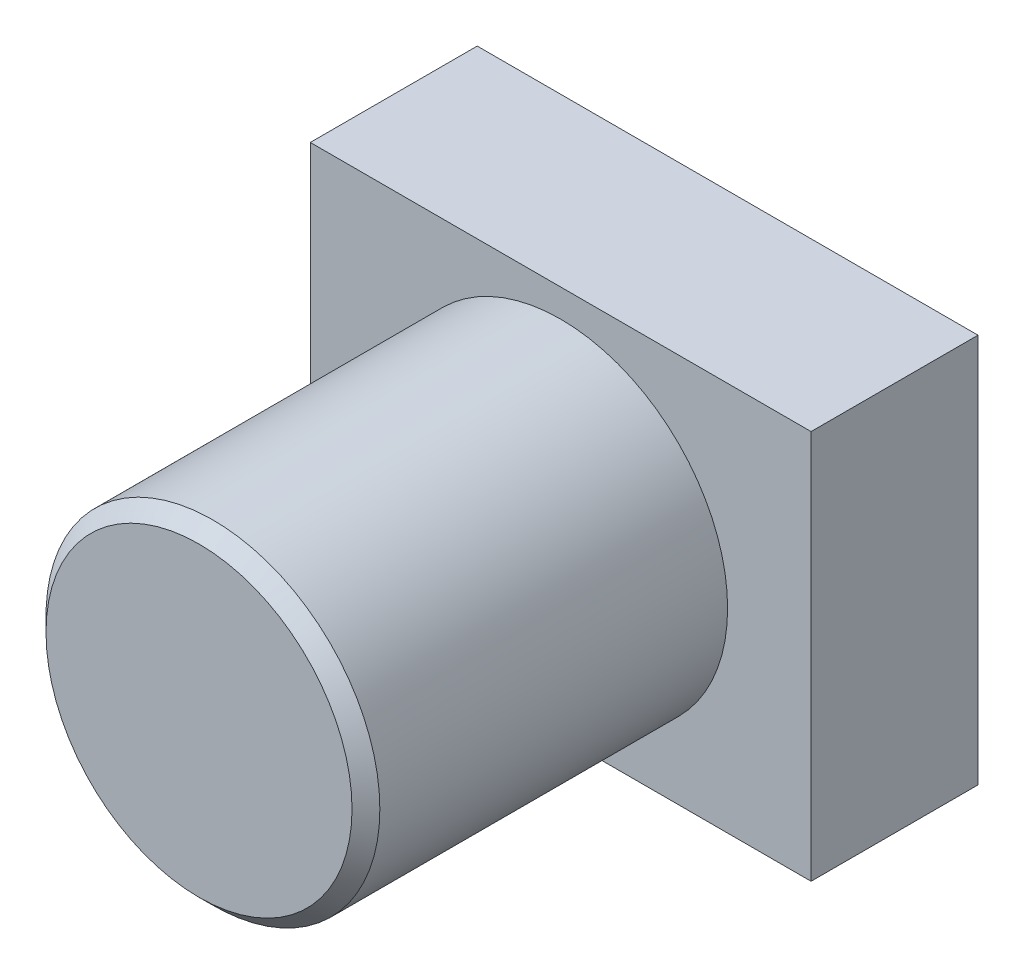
ISO-10303-21;
HEADER;
FILE_DESCRIPTION(('STEP AP214'),'2;1');
FILE_NAME('part.step','',(''),(''),'','','');
FILE_SCHEMA(('AUTOMOTIVE_DESIGN { 1 0 10303 214 1 1 1 1 }'));
ENDSEC;
DATA;
#1=APPLICATION_CONTEXT('core data for automotive mechanical design processes');
#2=APPLICATION_PROTOCOL_DEFINITION('international standard','automotive_design',2000,#1);
#3=PRODUCT_CONTEXT('',#1,'mechanical');
#4=PRODUCT('Part','Part','',(#3));
#5=PRODUCT_RELATED_PRODUCT_CATEGORY('part','',(#4));
#6=PRODUCT_DEFINITION_FORMATION('','',#4);
#7=PRODUCT_DEFINITION_CONTEXT('part definition',#1,'design');
#8=PRODUCT_DEFINITION('design','',#6,#7);
#9=PRODUCT_DEFINITION_SHAPE('','',#8);
#10=(LENGTH_UNIT() NAMED_UNIT(*) SI_UNIT(.MILLI.,.METRE.));
#11=(NAMED_UNIT(*) PLANE_ANGLE_UNIT() SI_UNIT($,.RADIAN.));
#12=(NAMED_UNIT(*) SI_UNIT($,.STERADIAN.) SOLID_ANGLE_UNIT());
#13=UNCERTAINTY_MEASURE_WITH_UNIT(LENGTH_MEASURE(1.E-05),#10,'distance_accuracy_value','');
#14=(GEOMETRIC_REPRESENTATION_CONTEXT(3) GLOBAL_UNCERTAINTY_ASSIGNED_CONTEXT((#13)) GLOBAL_UNIT_ASSIGNED_CONTEXT((#10,
#11,#12)) REPRESENTATION_CONTEXT('',''));
#15=CARTESIAN_POINT('',(0.,0.,0.));
#16=DIRECTION('',(0.,0.,1.));
#17=DIRECTION('',(1.,0.,0.));
#18=AXIS2_PLACEMENT_3D('',#15,#16,#17);
#19=CARTESIAN_POINT('',(0.,0.,0.));
#20=DIRECTION('',(0.,0.,1.));
#21=DIRECTION('',(1.,0.,0.));
#22=AXIS2_PLACEMENT_3D('',#19,#20,#21);
#23=CYLINDRICAL_SURFACE('',#22,6.);
#24=CARTESIAN_POINT('',(0.,0.,12.5));
#25=DIRECTION('',(0.,0.,1.));
#26=DIRECTION('',(1.,0.,0.));
#27=AXIS2_PLACEMENT_3D('',#24,#25,#26);
#28=CIRCLE('',#27,6.);
#29=CARTESIAN_POINT('',(6.,0.,12.5));
#30=VERTEX_POINT('',#29);
#31=EDGE_CURVE('E9',#30,#30,#28,.F.);
#32=ORIENTED_EDGE('',*,*,#31,.T.);
#33=EDGE_LOOP('',(#32));
#34=FACE_BOUND('',#33,.T.);
#35=CARTESIAN_POINT('',(0.,0.,0.));
#36=DIRECTION('',(0.,0.,-1.));
#37=DIRECTION('',(-1.,0.,0.));
#38=AXIS2_PLACEMENT_3D('',#35,#36,#37);
#39=CIRCLE('',#38,6.);
#40=CARTESIAN_POINT('',(-6.,0.,0.));
#41=VERTEX_POINT('',#40);
#42=EDGE_CURVE('E72',#41,#41,#39,.T.);
#43=ORIENTED_EDGE('',*,*,#42,.F.);
#44=EDGE_LOOP('',(#43));
#45=FACE_BOUND('',#44,.T.);
#46=ADVANCED_FACE('F14',(#34,#45),#23,.T.);
#47=CARTESIAN_POINT('',(-9.,-7.,0.));
#48=DIRECTION('',(0.,0.,-1.));
#49=DIRECTION('',(-1.,0.,0.));
#50=AXIS2_PLACEMENT_3D('',#47,#48,#49);
#51=PLANE('',#50);
#52=DIRECTION('',(0.,1.,0.));
#53=VECTOR('',#52,1.);
#54=CARTESIAN_POINT('',(-9.,7.,0.));
#55=LINE('',#54,#53);
#56=CARTESIAN_POINT('',(-9.,-7.,0.));
#57=VERTEX_POINT('',#56);
#58=CARTESIAN_POINT('',(-9.,7.,0.));
#59=VERTEX_POINT('',#58);
#60=EDGE_CURVE('E60',#57,#59,#55,.T.);
#61=ORIENTED_EDGE('',*,*,#60,.F.);
#62=DIRECTION('',(-1.,0.,0.));
#63=VECTOR('',#62,1.);
#64=CARTESIAN_POINT('',(9.,-7.,0.));
#65=LINE('',#64,#63);
#66=CARTESIAN_POINT('',(9.,-7.,0.));
#67=VERTEX_POINT('',#66);
#68=EDGE_CURVE('E81',#67,#57,#65,.T.);
#69=ORIENTED_EDGE('',*,*,#68,.F.);
#70=DIRECTION('',(0.,-1.,0.));
#71=VECTOR('',#70,1.);
#72=CARTESIAN_POINT('',(9.,7.,0.));
#73=LINE('',#72,#71);
#74=CARTESIAN_POINT('',(9.,7.,0.));
#75=VERTEX_POINT('',#74);
#76=EDGE_CURVE('E61',#75,#67,#73,.T.);
#77=ORIENTED_EDGE('',*,*,#76,.F.);
#78=DIRECTION('',(1.,0.,0.));
#79=VECTOR('',#78,1.);
#80=CARTESIAN_POINT('',(9.,7.,0.));
#81=LINE('',#80,#79);
#82=EDGE_CURVE('E54',#59,#75,#81,.T.);
#83=ORIENTED_EDGE('',*,*,#82,.F.);
#84=EDGE_LOOP('',(#61,#69,#77,#83));
#85=FACE_BOUND('',#84,.T.);
#86=ORIENTED_EDGE('',*,*,#42,.T.);
#87=EDGE_LOOP('',(#86));
#88=FACE_BOUND('',#87,.T.);
#89=ADVANCED_FACE('F56',(#85,#88),#51,.F.);
#90=CARTESIAN_POINT('',(-9.,7.,-6.));
#91=DIRECTION('',(1.,0.,0.));
#92=DIRECTION('',(0.,0.,-1.));
#93=AXIS2_PLACEMENT_3D('',#90,#91,#92);
#94=PLANE('',#93);
#95=ORIENTED_EDGE('',*,*,#60,.T.);
#96=DIRECTION('',(0.,0.,1.));
#97=VECTOR('',#96,1.);
#98=CARTESIAN_POINT('',(-9.,7.,-6.));
#99=LINE('',#98,#97);
#100=CARTESIAN_POINT('',(-9.,7.,-6.));
#101=VERTEX_POINT('',#100);
#102=EDGE_CURVE('E67',#101,#59,#99,.T.);
#103=ORIENTED_EDGE('',*,*,#102,.F.);
#104=DIRECTION('',(0.,1.,0.));
#105=VECTOR('',#104,1.);
#106=CARTESIAN_POINT('',(-9.,7.,-6.));
#107=LINE('',#106,#105);
#108=CARTESIAN_POINT('',(-9.,-7.,-6.));
#109=VERTEX_POINT('',#108);
#110=EDGE_CURVE('E83',#109,#101,#107,.T.);
#111=ORIENTED_EDGE('',*,*,#110,.F.);
#112=DIRECTION('',(0.,0.,1.));
#113=VECTOR('',#112,1.);
#114=CARTESIAN_POINT('',(-9.,-7.,-6.));
#115=LINE('',#114,#113);
#116=EDGE_CURVE('E77',#109,#57,#115,.T.);
#117=ORIENTED_EDGE('',*,*,#116,.T.);
#118=EDGE_LOOP('',(#95,#103,#111,#117));
#119=FACE_BOUND('',#118,.T.);
#120=ADVANCED_FACE('F76',(#119),#94,.F.);
#121=CARTESIAN_POINT('',(9.,7.,-6.));
#122=DIRECTION('',(0.,-1.,0.));
#123=DIRECTION('',(0.,0.,1.));
#124=AXIS2_PLACEMENT_3D('',#121,#122,#123);
#125=PLANE('',#124);
#126=ORIENTED_EDGE('',*,*,#82,.T.);
#127=DIRECTION('',(0.,0.,1.));
#128=VECTOR('',#127,1.);
#129=CARTESIAN_POINT('',(9.,7.,-6.));
#130=LINE('',#129,#128);
#131=CARTESIAN_POINT('',(9.,7.,-6.));
#132=VERTEX_POINT('',#131);
#133=EDGE_CURVE('E73',#132,#75,#130,.T.);
#134=ORIENTED_EDGE('',*,*,#133,.F.);
#135=DIRECTION('',(1.,0.,0.));
#136=VECTOR('',#135,1.);
#137=CARTESIAN_POINT('',(9.,7.,-6.));
#138=LINE('',#137,#136);
#139=EDGE_CURVE('E69',#101,#132,#138,.T.);
#140=ORIENTED_EDGE('',*,*,#139,.F.);
#141=ORIENTED_EDGE('',*,*,#102,.T.);
#142=EDGE_LOOP('',(#126,#134,#140,#141));
#143=FACE_BOUND('',#142,.T.);
#144=ADVANCED_FACE('F68',(#143),#125,.F.);
#145=CARTESIAN_POINT('',(9.,7.,-6.));
#146=DIRECTION('',(-1.,0.,0.));
#147=DIRECTION('',(0.,0.,1.));
#148=AXIS2_PLACEMENT_3D('',#145,#146,#147);
#149=PLANE('',#148);
#150=ORIENTED_EDGE('',*,*,#76,.T.);
#151=DIRECTION('',(0.,0.,1.));
#152=VECTOR('',#151,1.);
#153=CARTESIAN_POINT('',(9.,-7.,-6.));
#154=LINE('',#153,#152);
#155=CARTESIAN_POINT('',(9.,-7.,-6.));
#156=VERTEX_POINT('',#155);
#157=EDGE_CURVE('E89',#156,#67,#154,.T.);
#158=ORIENTED_EDGE('',*,*,#157,.F.);
#159=DIRECTION('',(0.,-1.,0.));
#160=VECTOR('',#159,1.);
#161=CARTESIAN_POINT('',(9.,7.,-6.));
#162=LINE('',#161,#160);
#163=EDGE_CURVE('E33',#132,#156,#162,.T.);
#164=ORIENTED_EDGE('',*,*,#163,.F.);
#165=ORIENTED_EDGE('',*,*,#133,.T.);
#166=EDGE_LOOP('',(#150,#158,#164,#165));
#167=FACE_BOUND('',#166,.T.);
#168=ADVANCED_FACE('F130',(#167),#149,.F.);
#169=CARTESIAN_POINT('',(9.,-7.,-6.));
#170=DIRECTION('',(0.,1.,0.));
#171=DIRECTION('',(0.,0.,-1.));
#172=AXIS2_PLACEMENT_3D('',#169,#170,#171);
#173=PLANE('',#172);
#174=ORIENTED_EDGE('',*,*,#68,.T.);
#175=ORIENTED_EDGE('',*,*,#116,.F.);
#176=DIRECTION('',(-1.,0.,0.));
#177=VECTOR('',#176,1.);
#178=CARTESIAN_POINT('',(9.,-7.,-6.));
#179=LINE('',#178,#177);
#180=EDGE_CURVE('E28',#156,#109,#179,.T.);
#181=ORIENTED_EDGE('',*,*,#180,.F.);
#182=ORIENTED_EDGE('',*,*,#157,.T.);
#183=EDGE_LOOP('',(#174,#175,#181,#182));
#184=FACE_BOUND('',#183,.T.);
#185=ADVANCED_FACE('F127',(#184),#173,.F.);
#186=CARTESIAN_POINT('',(-9.,-7.,-6.));
#187=DIRECTION('',(0.,0.,-1.));
#188=DIRECTION('',(-1.,0.,0.));
#189=AXIS2_PLACEMENT_3D('',#186,#187,#188);
#190=PLANE('',#189);
#191=ORIENTED_EDGE('',*,*,#110,.T.);
#192=ORIENTED_EDGE('',*,*,#139,.T.);
#193=ORIENTED_EDGE('',*,*,#163,.T.);
#194=ORIENTED_EDGE('',*,*,#180,.T.);
#195=EDGE_LOOP('',(#191,#192,#193,#194));
#196=FACE_BOUND('',#195,.T.);
#197=ADVANCED_FACE('F108',(#196),#190,.T.);
#198=CARTESIAN_POINT('',(0.,0.,13.));
#199=DIRECTION('',(0.,0.,1.));
#200=DIRECTION('',(1.,0.,0.));
#201=AXIS2_PLACEMENT_3D('',#198,#199,#200);
#202=PLANE('',#201);
#203=CARTESIAN_POINT('',(0.,0.,13.));
#204=DIRECTION('',(0.,0.,1.));
#205=DIRECTION('',(1.,0.,0.));
#206=AXIS2_PLACEMENT_3D('',#203,#204,#205);
#207=CIRCLE('',#206,5.5);
#208=CARTESIAN_POINT('',(5.5,0.,13.));
#209=VERTEX_POINT('',#208);
#210=EDGE_CURVE('E21',#209,#209,#207,.T.);
#211=ORIENTED_EDGE('',*,*,#210,.T.);
#212=EDGE_LOOP('',(#211));
#213=FACE_BOUND('',#212,.T.);
#214=ADVANCED_FACE('F97',(#213),#202,.T.);
#215=CARTESIAN_POINT('',(0.,0.,13.));
#216=DIRECTION('',(0.,0.,-1.));
#217=DIRECTION('',(-1.,0.,0.));
#218=AXIS2_PLACEMENT_3D('',#215,#216,#217);
#219=CONICAL_SURFACE('',#218,5.5,0.785398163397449);
#220=ORIENTED_EDGE('',*,*,#31,.F.);
#221=EDGE_LOOP('',(#220));
#222=FACE_BOUND('',#221,.T.);
#223=ORIENTED_EDGE('',*,*,#210,.F.);
#224=EDGE_LOOP('',(#223));
#225=FACE_BOUND('',#224,.T.);
#226=ADVANCED_FACE('F99',(#222,#225),#219,.T.);
#227=CLOSED_SHELL('',(#46,#89,#120,#144,#168,#185,#197,#214,#226));
#228=MANIFOLD_SOLID_BREP('B1',#227);
#229=ADVANCED_BREP_SHAPE_REPRESENTATION('',(#18,#228),#14);
#230=SHAPE_DEFINITION_REPRESENTATION(#9,#229);
ENDSEC;
END-ISO-10303-21;
